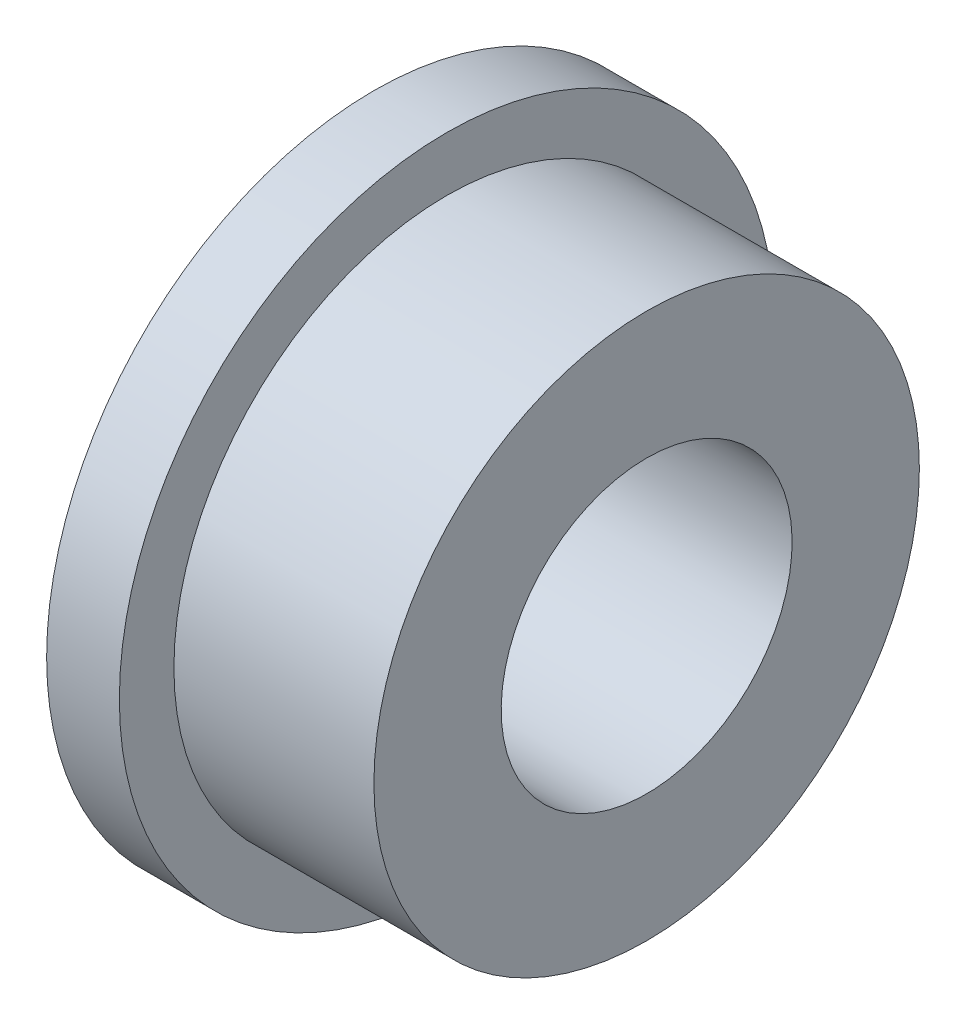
ISO-10303-21;
HEADER;
FILE_DESCRIPTION(('STEP AP214'),'2;1');
FILE_NAME('part.step','',(''),(''),'','','');
FILE_SCHEMA(('AUTOMOTIVE_DESIGN { 1 0 10303 214 1 1 1 1 }'));
ENDSEC;
DATA;
#1=APPLICATION_CONTEXT('core data for automotive mechanical design processes');
#2=APPLICATION_PROTOCOL_DEFINITION('international standard','automotive_design',2000,#1);
#3=PRODUCT_CONTEXT('',#1,'mechanical');
#4=PRODUCT('Part','Part','',(#3));
#5=PRODUCT_RELATED_PRODUCT_CATEGORY('part','',(#4));
#6=PRODUCT_DEFINITION_FORMATION('','',#4);
#7=PRODUCT_DEFINITION_CONTEXT('part definition',#1,'design');
#8=PRODUCT_DEFINITION('design','',#6,#7);
#9=PRODUCT_DEFINITION_SHAPE('','',#8);
#10=(LENGTH_UNIT() NAMED_UNIT(*) SI_UNIT(.MILLI.,.METRE.));
#11=(NAMED_UNIT(*) PLANE_ANGLE_UNIT() SI_UNIT($,.RADIAN.));
#12=(NAMED_UNIT(*) SI_UNIT($,.STERADIAN.) SOLID_ANGLE_UNIT());
#13=UNCERTAINTY_MEASURE_WITH_UNIT(LENGTH_MEASURE(1.E-05),#10,'distance_accuracy_value','');
#14=(GEOMETRIC_REPRESENTATION_CONTEXT(3) GLOBAL_UNCERTAINTY_ASSIGNED_CONTEXT((#13)) GLOBAL_UNIT_ASSIGNED_CONTEXT((#10,
#11,#12)) REPRESENTATION_CONTEXT('',''));
#15=CARTESIAN_POINT('',(0.,0.,0.));
#16=DIRECTION('',(0.,0.,1.));
#17=DIRECTION('',(1.,0.,0.));
#18=AXIS2_PLACEMENT_3D('',#15,#16,#17);
#19=CARTESIAN_POINT('',(0.,4.,0.));
#20=DIRECTION('',(1.,0.,0.));
#21=DIRECTION('',(0.,1.,0.));
#22=AXIS2_PLACEMENT_3D('',#19,#20,#21);
#23=PLANE('',#22);
#24=CARTESIAN_POINT('',(0.,0.,0.));
#25=DIRECTION('',(1.,0.,0.));
#26=DIRECTION('',(0.,1.,0.));
#27=AXIS2_PLACEMENT_3D('',#24,#25,#26);
#28=CIRCLE('',#27,7.5);
#29=CARTESIAN_POINT('',(0.,7.5,0.));
#30=VERTEX_POINT('',#29);
#31=EDGE_CURVE('E10',#30,#30,#28,.T.);
#32=ORIENTED_EDGE('',*,*,#31,.T.);
#33=EDGE_LOOP('',(#32));
#34=FACE_BOUND('',#33,.T.);
#35=CARTESIAN_POINT('',(0.,0.,0.));
#36=DIRECTION('',(1.,0.,0.));
#37=DIRECTION('',(0.,1.,0.));
#38=AXIS2_PLACEMENT_3D('',#35,#36,#37);
#39=CIRCLE('',#38,4.);
#40=CARTESIAN_POINT('',(0.,4.,0.));
#41=VERTEX_POINT('',#40);
#42=EDGE_CURVE('E370',#41,#41,#39,.T.);
#43=ORIENTED_EDGE('',*,*,#42,.F.);
#44=EDGE_LOOP('',(#43));
#45=FACE_BOUND('',#44,.T.);
#46=ADVANCED_FACE('F348',(#34,#45),#23,.T.);
#47=CARTESIAN_POINT('',(0.,0.,0.));
#48=DIRECTION('',(1.,0.,0.));
#49=DIRECTION('',(0.,1.,0.));
#50=AXIS2_PLACEMENT_3D('',#47,#48,#49);
#51=CYLINDRICAL_SURFACE('',#50,7.5);
#52=CARTESIAN_POINT('',(-5.5,0.,0.));
#53=DIRECTION('',(1.,0.,0.));
#54=DIRECTION('',(0.,1.,0.));
#55=AXIS2_PLACEMENT_3D('',#52,#53,#54);
#56=CIRCLE('',#55,7.5);
#57=CARTESIAN_POINT('',(-5.5,7.5,0.));
#58=VERTEX_POINT('',#57);
#59=EDGE_CURVE('E354',#58,#58,#56,.T.);
#60=ORIENTED_EDGE('',*,*,#59,.T.);
#61=EDGE_LOOP('',(#60));
#62=FACE_BOUND('',#61,.T.);
#63=ORIENTED_EDGE('',*,*,#31,.F.);
#64=EDGE_LOOP('',(#63));
#65=FACE_BOUND('',#64,.T.);
#66=ADVANCED_FACE('F378',(#62,#65),#51,.T.);
#67=CARTESIAN_POINT('',(-5.5,7.5,0.));
#68=DIRECTION('',(1.,0.,0.));
#69=DIRECTION('',(0.,1.,0.));
#70=AXIS2_PLACEMENT_3D('',#67,#68,#69);
#71=PLANE('',#70);
#72=CARTESIAN_POINT('',(-5.5,0.,0.));
#73=DIRECTION('',(1.,0.,0.));
#74=DIRECTION('',(0.,1.,0.));
#75=AXIS2_PLACEMENT_3D('',#72,#73,#74);
#76=CIRCLE('',#75,9.);
#77=CARTESIAN_POINT('',(-5.5,9.,0.));
#78=VERTEX_POINT('',#77);
#79=EDGE_CURVE('E358',#78,#78,#76,.T.);
#80=ORIENTED_EDGE('',*,*,#79,.T.);
#81=EDGE_LOOP('',(#80));
#82=FACE_BOUND('',#81,.T.);
#83=ORIENTED_EDGE('',*,*,#59,.F.);
#84=EDGE_LOOP('',(#83));
#85=FACE_BOUND('',#84,.T.);
#86=ADVANCED_FACE('F382',(#82,#85),#71,.T.);
#87=CARTESIAN_POINT('',(0.,0.,0.));
#88=DIRECTION('',(1.,0.,0.));
#89=DIRECTION('',(0.,1.,0.));
#90=AXIS2_PLACEMENT_3D('',#87,#88,#89);
#91=CYLINDRICAL_SURFACE('',#90,9.);
#92=CARTESIAN_POINT('',(-7.5,0.,0.));
#93=DIRECTION('',(1.,0.,0.));
#94=DIRECTION('',(0.,1.,0.));
#95=AXIS2_PLACEMENT_3D('',#92,#93,#94);
#96=CIRCLE('',#95,9.);
#97=CARTESIAN_POINT('',(-7.5,9.,0.));
#98=VERTEX_POINT('',#97);
#99=EDGE_CURVE('E362',#98,#98,#96,.T.);
#100=ORIENTED_EDGE('',*,*,#99,.T.);
#101=EDGE_LOOP('',(#100));
#102=FACE_BOUND('',#101,.T.);
#103=ORIENTED_EDGE('',*,*,#79,.F.);
#104=EDGE_LOOP('',(#103));
#105=FACE_BOUND('',#104,.T.);
#106=ADVANCED_FACE('F386',(#102,#105),#91,.T.);
#107=CARTESIAN_POINT('',(-7.5,9.,0.));
#108=DIRECTION('',(-1.,0.,0.));
#109=DIRECTION('',(0.,-1.,0.));
#110=AXIS2_PLACEMENT_3D('',#107,#108,#109);
#111=PLANE('',#110);
#112=CARTESIAN_POINT('',(-7.5,0.,0.));
#113=DIRECTION('',(1.,0.,0.));
#114=DIRECTION('',(0.,1.,0.));
#115=AXIS2_PLACEMENT_3D('',#112,#113,#114);
#116=CIRCLE('',#115,4.);
#117=CARTESIAN_POINT('',(-7.5,4.,0.));
#118=VERTEX_POINT('',#117);
#119=EDGE_CURVE('E367',#118,#118,#116,.T.);
#120=ORIENTED_EDGE('',*,*,#119,.T.);
#121=EDGE_LOOP('',(#120));
#122=FACE_BOUND('',#121,.T.);
#123=ORIENTED_EDGE('',*,*,#99,.F.);
#124=EDGE_LOOP('',(#123));
#125=FACE_BOUND('',#124,.T.);
#126=ADVANCED_FACE('F393',(#122,#125),#111,.T.);
#127=CARTESIAN_POINT('',(0.,0.,0.));
#128=DIRECTION('',(1.,0.,0.));
#129=DIRECTION('',(0.,1.,0.));
#130=AXIS2_PLACEMENT_3D('',#127,#128,#129);
#131=CYLINDRICAL_SURFACE('',#130,4.);
#132=ORIENTED_EDGE('',*,*,#42,.T.);
#133=EDGE_LOOP('',(#132));
#134=FACE_BOUND('',#133,.T.);
#135=ORIENTED_EDGE('',*,*,#119,.F.);
#136=EDGE_LOOP('',(#135));
#137=FACE_BOUND('',#136,.T.);
#138=ADVANCED_FACE('F374',(#134,#137),#131,.F.);
#139=CLOSED_SHELL('',(#46,#66,#86,#106,#126,#138));
#140=MANIFOLD_SOLID_BREP('B2',#139);
#141=ADVANCED_BREP_SHAPE_REPRESENTATION('',(#18,#140),#14);
#142=SHAPE_DEFINITION_REPRESENTATION(#9,#141);
ENDSEC;
END-ISO-10303-21;
